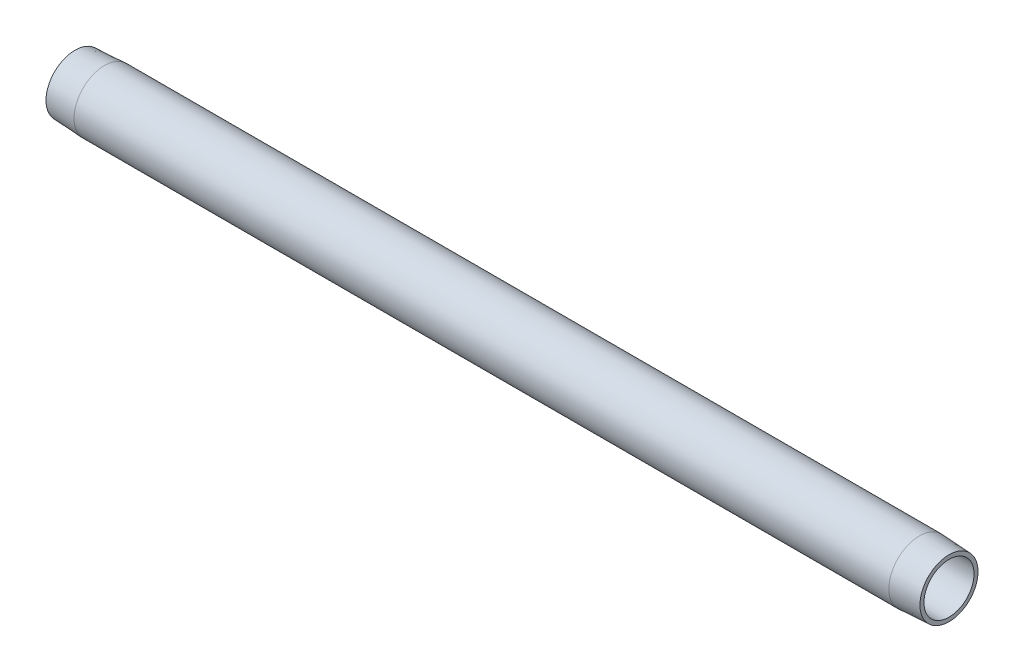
from build123d import *


with BuildPart() as part:
    # Sketch1 → Revolve1 (revolve)
    with BuildSketch(Plane.XY, mode=Mode.PRIVATE) as revolve1_sk:
        Polygon((304.8, 8.73125), (0, 8.73125), (0, 10.127550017), (10.3124, 10.668), (294.4876, 10.668), (304.8, 10.127550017), align=None)
    revolve(revolve1_sk.sketch.rotate(Axis((0, 0, 0), (1, 0, 0)), 90), axis=Axis((0, 0, 0), (1, 0, 0)))


solid = part.part
